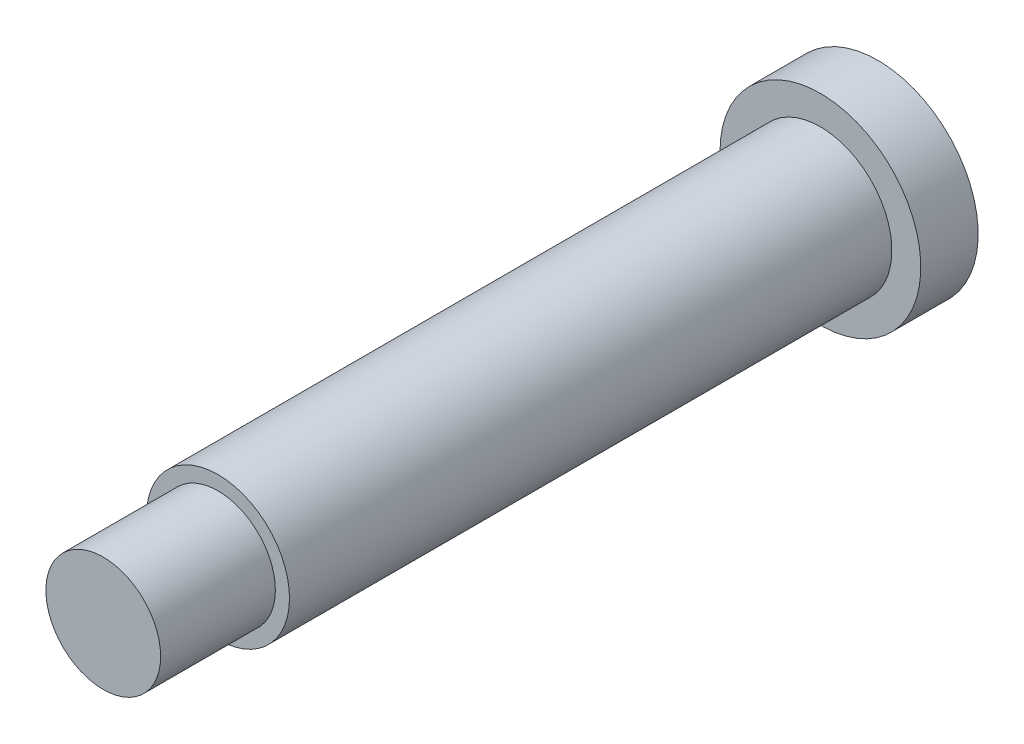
from build123d import *

# Parameters (mm, degrees)
SKETCH1_R           = 7.9121
BASE_EXTRUDE_DEPTH  = 66.675
SKETCH2_R           = 6.35
BOSS_EXTRUDE1_DEPTH = 12.7
SKETCH3_R           = 11.1125
BOSS_EXTRUDE2_DEPTH = 6.35


with BuildPart() as part:
    # Sketch1 → Base-Extrude (new body)
    with BuildSketch(Plane.XY):
        Circle(SKETCH1_R)
    extrude(amount=BASE_EXTRUDE_DEPTH)

    # Sketch2 → Boss-Extrude1 (add)
    with BuildSketch(Plane.XY.offset(66.675)):
        Circle(SKETCH2_R)
    extrude(amount=BOSS_EXTRUDE1_DEPTH)

    # Sketch3 → Boss-Extrude2 (add)
    with BuildSketch(Plane(origin=(0, 0, 0), x_dir=(-1, 0, 0), z_dir=(0, 0, -1))):
        Circle(SKETCH3_R)
    extrude(amount=BOSS_EXTRUDE2_DEPTH)


solid = part.part
